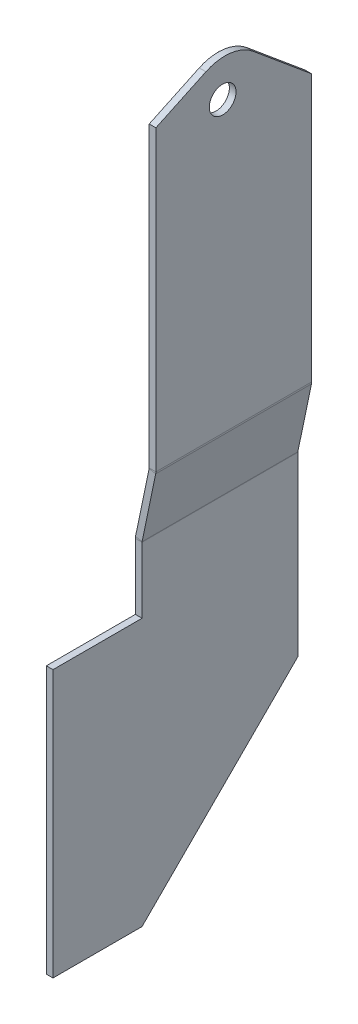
ISO-10303-21;
HEADER;
FILE_DESCRIPTION(('STEP AP214'),'2;1');
FILE_NAME('part.step','',(''),(''),'','','');
FILE_SCHEMA(('AUTOMOTIVE_DESIGN { 1 0 10303 214 1 1 1 1 }'));
ENDSEC;
DATA;
#1=APPLICATION_CONTEXT('core data for automotive mechanical design processes');
#2=APPLICATION_PROTOCOL_DEFINITION('international standard','automotive_design',2000,#1);
#3=PRODUCT_CONTEXT('',#1,'mechanical');
#4=PRODUCT('Part','Part','',(#3));
#5=PRODUCT_RELATED_PRODUCT_CATEGORY('part','',(#4));
#6=PRODUCT_DEFINITION_FORMATION('','',#4);
#7=PRODUCT_DEFINITION_CONTEXT('part definition',#1,'design');
#8=PRODUCT_DEFINITION('design','',#6,#7);
#9=PRODUCT_DEFINITION_SHAPE('','',#8);
#10=(LENGTH_UNIT() NAMED_UNIT(*) SI_UNIT(.MILLI.,.METRE.));
#11=(NAMED_UNIT(*) PLANE_ANGLE_UNIT() SI_UNIT($,.RADIAN.));
#12=(NAMED_UNIT(*) SI_UNIT($,.STERADIAN.) SOLID_ANGLE_UNIT());
#13=UNCERTAINTY_MEASURE_WITH_UNIT(LENGTH_MEASURE(1.E-05),#10,'distance_accuracy_value','');
#14=(GEOMETRIC_REPRESENTATION_CONTEXT(3) GLOBAL_UNCERTAINTY_ASSIGNED_CONTEXT((#13)) GLOBAL_UNIT_ASSIGNED_CONTEXT((#10,
#11,#12)) REPRESENTATION_CONTEXT('',''));
#15=CARTESIAN_POINT('',(0.,0.,0.));
#16=DIRECTION('',(0.,0.,1.));
#17=DIRECTION('',(1.,0.,0.));
#18=AXIS2_PLACEMENT_3D('',#15,#16,#17);
#19=CARTESIAN_POINT('',(0.,0.,110.));
#20=DIRECTION('',(-1.,0.,0.));
#21=DIRECTION('',(0.,0.,1.));
#22=AXIS2_PLACEMENT_3D('',#19,#20,#21);
#23=PLANE('',#22);
#24=DIRECTION('',(0.,1.,0.));
#25=VECTOR('',#24,1.);
#26=CARTESIAN_POINT('',(0.,0.,0.));
#27=LINE('',#26,#25);
#28=CARTESIAN_POINT('',(0.,70.,0.));
#29=VERTEX_POINT('',#28);
#30=CARTESIAN_POINT('',(0.,149.577452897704,0.));
#31=VERTEX_POINT('',#30);
#32=EDGE_CURVE('E178',#29,#31,#27,.T.);
#33=ORIENTED_EDGE('',*,*,#32,.F.);
#34=DIRECTION('',(0.,0.707106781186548,-0.707106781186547));
#35=VECTOR('',#34,1.);
#36=CARTESIAN_POINT('',(0.,-20.,90.));
#37=LINE('',#36,#35);
#38=CARTESIAN_POINT('',(0.,0.,70.));
#39=VERTEX_POINT('',#38);
#40=EDGE_CURVE('E155',#39,#29,#37,.T.);
#41=ORIENTED_EDGE('',*,*,#40,.F.);
#42=DIRECTION('',(0.,0.,-1.));
#43=VECTOR('',#42,1.);
#44=CARTESIAN_POINT('',(0.,0.,110.));
#45=LINE('',#44,#43);
#46=CARTESIAN_POINT('',(0.,0.,110.));
#47=VERTEX_POINT('',#46);
#48=EDGE_CURVE('E210',#47,#39,#45,.T.);
#49=ORIENTED_EDGE('',*,*,#48,.F.);
#50=DIRECTION('',(0.,1.,0.));
#51=VECTOR('',#50,1.);
#52=CARTESIAN_POINT('',(0.,0.,110.));
#53=LINE('',#52,#51);
#54=CARTESIAN_POINT('',(0.,120.,110.));
#55=VERTEX_POINT('',#54);
#56=EDGE_CURVE('E192',#47,#55,#53,.T.);
#57=ORIENTED_EDGE('',*,*,#56,.T.);
#58=DIRECTION('',(0.,0.,1.));
#59=VECTOR('',#58,1.);
#60=CARTESIAN_POINT('',(0.,120.,110.));
#61=LINE('',#60,#59);
#62=CARTESIAN_POINT('',(0.,120.,70.));
#63=VERTEX_POINT('',#62);
#64=EDGE_CURVE('E403',#63,#55,#61,.T.);
#65=ORIENTED_EDGE('',*,*,#64,.F.);
#66=DIRECTION('',(0.,1.,0.));
#67=VECTOR('',#66,1.);
#68=CARTESIAN_POINT('',(0.,0.,70.));
#69=LINE('',#68,#67);
#70=CARTESIAN_POINT('',(0.,149.577452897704,70.));
#71=VERTEX_POINT('',#70);
#72=EDGE_CURVE('E395',#71,#63,#69,.F.);
#73=ORIENTED_EDGE('',*,*,#72,.F.);
#74=DIRECTION('',(0.,0.,-1.));
#75=VECTOR('',#74,1.);
#76=CARTESIAN_POINT('',(0.,149.577452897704,110.));
#77=LINE('',#76,#75);
#78=EDGE_CURVE('E213',#71,#31,#77,.T.);
#79=ORIENTED_EDGE('',*,*,#78,.T.);
#80=EDGE_LOOP('',(#33,#41,#49,#57,#65,#73,#79));
#81=FACE_BOUND('',#80,.T.);
#82=ADVANCED_FACE('F33',(#81),#23,.T.);
#83=CARTESIAN_POINT('',(3.,0.,110.));
#84=DIRECTION('',(-1.,0.,0.));
#85=DIRECTION('',(0.,0.,1.));
#86=AXIS2_PLACEMENT_3D('',#83,#84,#85);
#87=PLANE('',#86);
#88=DIRECTION('',(0.,0.707106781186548,-0.707106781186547));
#89=VECTOR('',#88,1.);
#90=CARTESIAN_POINT('',(3.,-20.,90.));
#91=LINE('',#90,#89);
#92=CARTESIAN_POINT('',(3.,0.,70.));
#93=VERTEX_POINT('',#92);
#94=CARTESIAN_POINT('',(3.,70.,0.));
#95=VERTEX_POINT('',#94);
#96=EDGE_CURVE('E152',#93,#95,#91,.T.);
#97=ORIENTED_EDGE('',*,*,#96,.T.);
#98=DIRECTION('',(0.,1.,0.));
#99=VECTOR('',#98,1.);
#100=CARTESIAN_POINT('',(3.,0.,0.));
#101=LINE('',#100,#99);
#102=CARTESIAN_POINT('',(2.99999999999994,149.577452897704,0.));
#103=VERTEX_POINT('',#102);
#104=EDGE_CURVE('E166',#95,#103,#101,.T.);
#105=ORIENTED_EDGE('',*,*,#104,.T.);
#106=DIRECTION('',(0.,0.,-1.));
#107=VECTOR('',#106,1.);
#108=CARTESIAN_POINT('',(2.99999999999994,149.577452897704,110.));
#109=LINE('',#108,#107);
#110=CARTESIAN_POINT('',(2.99999999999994,149.577452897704,70.));
#111=VERTEX_POINT('',#110);
#112=EDGE_CURVE('E207',#111,#103,#109,.T.);
#113=ORIENTED_EDGE('',*,*,#112,.F.);
#114=DIRECTION('',(0.,-1.,0.));
#115=VECTOR('',#114,1.);
#116=CARTESIAN_POINT('',(3.,0.,70.));
#117=LINE('',#116,#115);
#118=CARTESIAN_POINT('',(3.,120.,70.));
#119=VERTEX_POINT('',#118);
#120=EDGE_CURVE('E388',#111,#119,#117,.T.);
#121=ORIENTED_EDGE('',*,*,#120,.T.);
#122=DIRECTION('',(0.,0.,1.));
#123=VECTOR('',#122,1.);
#124=CARTESIAN_POINT('',(3.,120.,110.));
#125=LINE('',#124,#123);
#126=CARTESIAN_POINT('',(3.,120.,110.));
#127=VERTEX_POINT('',#126);
#128=EDGE_CURVE('E389',#119,#127,#125,.T.);
#129=ORIENTED_EDGE('',*,*,#128,.T.);
#130=DIRECTION('',(0.,1.,0.));
#131=VECTOR('',#130,1.);
#132=CARTESIAN_POINT('',(3.,0.,110.));
#133=LINE('',#132,#131);
#134=CARTESIAN_POINT('',(3.,0.,110.));
#135=VERTEX_POINT('',#134);
#136=EDGE_CURVE('E198',#135,#127,#133,.T.);
#137=ORIENTED_EDGE('',*,*,#136,.F.);
#138=DIRECTION('',(0.,0.,-1.));
#139=VECTOR('',#138,1.);
#140=CARTESIAN_POINT('',(3.,0.,110.));
#141=LINE('',#140,#139);
#142=EDGE_CURVE('E169',#135,#93,#141,.T.);
#143=ORIENTED_EDGE('',*,*,#142,.T.);
#144=EDGE_LOOP('',(#97,#105,#113,#121,#129,#137,#143));
#145=FACE_BOUND('',#144,.T.);
#146=ADVANCED_FACE('F164',(#145),#87,.F.);
#147=CARTESIAN_POINT('',(3.02312153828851,149.801802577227,0.));
#148=DIRECTION('',(0.,0.,-1.));
#149=DIRECTION('',(-1.,0.,0.));
#150=AXIS2_PLACEMENT_3D('',#147,#148,#149);
#151=PLANE('',#150);
#152=ORIENTED_EDGE('',*,*,#104,.F.);
#153=DIRECTION('',(1.,0.,0.));
#154=VECTOR('',#153,1.);
#155=CARTESIAN_POINT('',(3.,70.,0.));
#156=LINE('',#155,#154);
#157=EDGE_CURVE('E149',#95,#29,#156,.F.);
#158=ORIENTED_EDGE('',*,*,#157,.T.);
#159=ORIENTED_EDGE('',*,*,#32,.T.);
#160=DIRECTION('',(1.,0.,0.));
#161=VECTOR('',#160,1.);
#162=CARTESIAN_POINT('',(0.,149.577452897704,0.));
#163=LINE('',#162,#161);
#164=EDGE_CURVE('E175',#31,#103,#163,.T.);
#165=ORIENTED_EDGE('',*,*,#164,.T.);
#166=EDGE_LOOP('',(#152,#158,#159,#165));
#167=FACE_BOUND('',#166,.T.);
#168=ADVANCED_FACE('F173',(#167),#151,.T.);
#169=CARTESIAN_POINT('',(3.,0.,110.));
#170=DIRECTION('',(0.,-1.,0.));
#171=DIRECTION('',(0.,0.,-1.));
#172=AXIS2_PLACEMENT_3D('',#169,#170,#171);
#173=PLANE('',#172);
#174=ORIENTED_EDGE('',*,*,#48,.T.);
#175=DIRECTION('',(1.,0.,0.));
#176=VECTOR('',#175,1.);
#177=CARTESIAN_POINT('',(3.,0.,70.));
#178=LINE('',#177,#176);
#179=EDGE_CURVE('E160',#93,#39,#178,.F.);
#180=ORIENTED_EDGE('',*,*,#179,.F.);
#181=ORIENTED_EDGE('',*,*,#142,.F.);
#182=DIRECTION('',(-1.,0.,0.));
#183=VECTOR('',#182,1.);
#184=CARTESIAN_POINT('',(3.,0.,110.));
#185=LINE('',#184,#183);
#186=EDGE_CURVE('E195',#135,#47,#185,.T.);
#187=ORIENTED_EDGE('',*,*,#186,.T.);
#188=EDGE_LOOP('',(#174,#180,#181,#187));
#189=FACE_BOUND('',#188,.T.);
#190=ADVANCED_FACE('F334',(#189),#173,.T.);
#191=CARTESIAN_POINT('',(9.25000000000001,180.,110.));
#192=DIRECTION('',(-1.,0.,0.));
#193=DIRECTION('',(0.,0.,1.));
#194=AXIS2_PLACEMENT_3D('',#191,#192,#193);
#195=PLANE('',#194);
#196=CARTESIAN_POINT('',(9.25000000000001,310.,40.));
#197=DIRECTION('',(1.,0.,0.));
#198=DIRECTION('',(0.,0.,-1.));
#199=AXIS2_PLACEMENT_3D('',#196,#197,#198);
#200=CIRCLE('',#199,6.);
#201=CARTESIAN_POINT('',(9.25,310.,34.));
#202=VERTEX_POINT('',#201);
#203=EDGE_CURVE('E235',#202,#202,#200,.T.);
#204=ORIENTED_EDGE('',*,*,#203,.F.);
#205=EDGE_LOOP('',(#204));
#206=FACE_BOUND('',#205,.T.);
#207=DIRECTION('',(0.,0.640184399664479,0.768221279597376));
#208=VECTOR('',#207,1.);
#209=CARTESIAN_POINT('',(9.25000000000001,300.,0.));
#210=LINE('',#209,#208);
#211=CARTESIAN_POINT('',(9.25000000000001,300.,0.));
#212=VERTEX_POINT('',#211);
#213=CARTESIAN_POINT('',(9.25000000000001,321.842099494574,26.210519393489));
#214=VERTEX_POINT('',#213);
#215=EDGE_CURVE('E245',#212,#214,#210,.T.);
#216=ORIENTED_EDGE('',*,*,#215,.T.);
#217=CARTESIAN_POINT('',(9.25000000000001,306.477673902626,39.0142073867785));
#218=DIRECTION('',(-1.,0.,0.));
#219=DIRECTION('',(0.,0.,1.));
#220=AXIS2_PLACEMENT_3D('',#217,#218,#219);
#221=CIRCLE('',#220,20.);
#222=CARTESIAN_POINT('',(9.25000000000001,324.574047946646,47.5301481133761));
#223=VERTEX_POINT('',#222);
#224=EDGE_CURVE('E55',#214,#223,#221,.F.);
#225=ORIENTED_EDGE('',*,*,#224,.T.);
#226=DIRECTION('',(0.,0.425797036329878,-0.904818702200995));
#227=VECTOR('',#226,1.);
#228=CARTESIAN_POINT('',(9.25000000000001,314.,70.));
#229=LINE('',#228,#227);
#230=CARTESIAN_POINT('',(9.25000000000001,314.,70.));
#231=VERTEX_POINT('',#230);
#232=EDGE_CURVE('E240',#223,#231,#229,.F.);
#233=ORIENTED_EDGE('',*,*,#232,.T.);
#234=DIRECTION('',(0.,1.,0.));
#235=VECTOR('',#234,1.);
#236=CARTESIAN_POINT('',(9.25000000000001,120.,70.));
#237=LINE('',#236,#235);
#238=CARTESIAN_POINT('',(9.25000000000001,180.113366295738,70.));
#239=VERTEX_POINT('',#238);
#240=EDGE_CURVE('E428',#239,#231,#237,.T.);
#241=ORIENTED_EDGE('',*,*,#240,.F.);
#242=DIRECTION('',(0.,0.,-1.));
#243=VECTOR('',#242,1.);
#244=CARTESIAN_POINT('',(9.25000000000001,180.113366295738,110.));
#245=LINE('',#244,#243);
#246=CARTESIAN_POINT('',(9.25000000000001,180.113366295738,0.));
#247=VERTEX_POINT('',#246);
#248=EDGE_CURVE('E201',#239,#247,#245,.T.);
#249=ORIENTED_EDGE('',*,*,#248,.T.);
#250=DIRECTION('',(0.,1.,0.));
#251=VECTOR('',#250,1.);
#252=CARTESIAN_POINT('',(9.25000000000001,180.,0.));
#253=LINE('',#252,#251);
#254=EDGE_CURVE('E262',#247,#212,#253,.T.);
#255=ORIENTED_EDGE('',*,*,#254,.T.);
#256=EDGE_LOOP('',(#216,#225,#233,#241,#249,#255));
#257=FACE_BOUND('',#256,.T.);
#258=ADVANCED_FACE('F260',(#206,#257),#195,.F.);
#259=CARTESIAN_POINT('',(6.25000000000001,180.,110.));
#260=DIRECTION('',(-1.,0.,0.));
#261=DIRECTION('',(0.,0.,1.));
#262=AXIS2_PLACEMENT_3D('',#259,#260,#261);
#263=PLANE('',#262);
#264=CARTESIAN_POINT('',(6.25000000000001,310.,40.));
#265=DIRECTION('',(-1.,0.,0.));
#266=DIRECTION('',(0.,0.,1.));
#267=AXIS2_PLACEMENT_3D('',#264,#265,#266);
#268=CIRCLE('',#267,6.);
#269=CARTESIAN_POINT('',(6.25000000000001,310.,34.));
#270=VERTEX_POINT('',#269);
#271=EDGE_CURVE('E170',#270,#270,#268,.T.);
#272=ORIENTED_EDGE('',*,*,#271,.F.);
#273=EDGE_LOOP('',(#272));
#274=FACE_BOUND('',#273,.T.);
#275=DIRECTION('',(0.,-0.425797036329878,0.904818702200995));
#276=VECTOR('',#275,1.);
#277=CARTESIAN_POINT('',(6.25000000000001,274.294617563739,154.373937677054));
#278=LINE('',#277,#276);
#279=CARTESIAN_POINT('',(6.25000000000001,314.,70.));
#280=VERTEX_POINT('',#279);
#281=CARTESIAN_POINT('',(6.25000000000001,324.574047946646,47.5301481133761));
#282=VERTEX_POINT('',#281);
#283=EDGE_CURVE('E238',#280,#282,#278,.F.);
#284=ORIENTED_EDGE('',*,*,#283,.T.);
#285=CARTESIAN_POINT('',(6.25000000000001,306.477673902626,39.0142073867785));
#286=DIRECTION('',(-1.,0.,0.));
#287=DIRECTION('',(0.,0.,1.));
#288=AXIS2_PLACEMENT_3D('',#285,#286,#287);
#289=CIRCLE('',#288,20.);
#290=CARTESIAN_POINT('',(6.25000000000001,321.842099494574,26.210519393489));
#291=VERTEX_POINT('',#290);
#292=EDGE_CURVE('E11',#282,#291,#289,.T.);
#293=ORIENTED_EDGE('',*,*,#292,.T.);
#294=DIRECTION('',(0.,-0.640184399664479,-0.768221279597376));
#295=VECTOR('',#294,1.);
#296=CARTESIAN_POINT('',(6.25000000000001,304.918032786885,5.90163934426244));
#297=LINE('',#296,#295);
#298=CARTESIAN_POINT('',(6.25000000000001,300.,0.));
#299=VERTEX_POINT('',#298);
#300=EDGE_CURVE('E247',#291,#299,#297,.T.);
#301=ORIENTED_EDGE('',*,*,#300,.T.);
#302=DIRECTION('',(0.,1.,0.));
#303=VECTOR('',#302,1.);
#304=CARTESIAN_POINT('',(6.25000000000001,180.,0.));
#305=LINE('',#304,#303);
#306=CARTESIAN_POINT('',(6.25000000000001,180.113366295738,0.));
#307=VERTEX_POINT('',#306);
#308=EDGE_CURVE('E267',#307,#299,#305,.T.);
#309=ORIENTED_EDGE('',*,*,#308,.F.);
#310=DIRECTION('',(0.,0.,-1.));
#311=VECTOR('',#310,1.);
#312=CARTESIAN_POINT('',(6.25000000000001,180.113366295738,110.));
#313=LINE('',#312,#311);
#314=CARTESIAN_POINT('',(6.25,180.113366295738,70.));
#315=VERTEX_POINT('',#314);
#316=EDGE_CURVE('E220',#315,#307,#313,.T.);
#317=ORIENTED_EDGE('',*,*,#316,.F.);
#318=DIRECTION('',(0.,1.,0.));
#319=VECTOR('',#318,1.);
#320=CARTESIAN_POINT('',(6.25,180.,70.));
#321=LINE('',#320,#319);
#322=EDGE_CURVE('E398',#315,#280,#321,.T.);
#323=ORIENTED_EDGE('',*,*,#322,.T.);
#324=EDGE_LOOP('',(#284,#293,#301,#309,#317,#323));
#325=FACE_BOUND('',#324,.T.);
#326=ADVANCED_FACE('F316',(#274,#325),#263,.T.);
#327=CARTESIAN_POINT('',(5.15,180.113366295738,110.));
#328=DIRECTION('',(0.,0.,-1.));
#329=DIRECTION('',(-1.,0.,0.));
#330=AXIS2_PLACEMENT_3D('',#327,#328,#329);
#331=CYLINDRICAL_SURFACE('',#330,1.1);
#332=DIRECTION('',(0.,0.,-1.));
#333=VECTOR('',#332,1.);
#334=CARTESIAN_POINT('',(6.22687846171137,179.889016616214,110.));
#335=LINE('',#334,#333);
#336=CARTESIAN_POINT('',(6.22687846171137,179.889016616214,70.));
#337=VERTEX_POINT('',#336);
#338=CARTESIAN_POINT('',(6.22687846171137,179.889016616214,0.));
#339=VERTEX_POINT('',#338);
#340=EDGE_CURVE('E218',#337,#339,#335,.T.);
#341=ORIENTED_EDGE('',*,*,#340,.F.);
#342=CARTESIAN_POINT('',(5.15,180.113366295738,70.));
#343=DIRECTION('',(0.,0.,-1.));
#344=DIRECTION('',(-1.,0.,0.));
#345=AXIS2_PLACEMENT_3D('',#342,#343,#344);
#346=CIRCLE('',#345,1.1);
#347=EDGE_CURVE('E311',#315,#337,#346,.T.);
#348=ORIENTED_EDGE('',*,*,#347,.F.);
#349=ORIENTED_EDGE('',*,*,#316,.T.);
#350=CARTESIAN_POINT('',(5.15,180.113366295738,0.));
#351=DIRECTION('',(0.,0.,1.));
#352=DIRECTION('',(1.,0.,0.));
#353=AXIS2_PLACEMENT_3D('',#350,#351,#352);
#354=CIRCLE('',#353,1.1);
#355=EDGE_CURVE('E271',#339,#307,#354,.T.);
#356=ORIENTED_EDGE('',*,*,#355,.F.);
#357=EDGE_LOOP('',(#341,#348,#349,#356));
#358=FACE_BOUND('',#357,.T.);
#359=ADVANCED_FACE('F309',(#358),#331,.F.);
#360=CARTESIAN_POINT('',(0.,150.,110.));
#361=DIRECTION('',(-0.978980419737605,0.203954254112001,0.));
#362=DIRECTION('',(-0.203954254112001,-0.978980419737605,0.));
#363=AXIS2_PLACEMENT_3D('',#360,#361,#362);
#364=PLANE('',#363);
#365=DIRECTION('',(0.,0.,-1.));
#366=VECTOR('',#365,1.);
#367=CARTESIAN_POINT('',(0.0861802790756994,150.413665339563,110.));
#368=LINE('',#367,#366);
#369=CARTESIAN_POINT('',(0.0861802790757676,150.413665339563,70.));
#370=VERTEX_POINT('',#369);
#371=CARTESIAN_POINT('',(0.0861802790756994,150.413665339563,0.));
#372=VERTEX_POINT('',#371);
#373=EDGE_CURVE('E216',#370,#372,#368,.T.);
#374=ORIENTED_EDGE('',*,*,#373,.F.);
#375=DIRECTION('',(-0.203954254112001,-0.978980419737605,0.));
#376=VECTOR('',#375,1.);
#377=CARTESIAN_POINT('',(0.,150.,70.));
#378=LINE('',#377,#376);
#379=EDGE_CURVE('E303',#337,#370,#378,.T.);
#380=ORIENTED_EDGE('',*,*,#379,.F.);
#381=ORIENTED_EDGE('',*,*,#340,.T.);
#382=DIRECTION('',(0.203954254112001,0.978980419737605,0.));
#383=VECTOR('',#382,1.);
#384=CARTESIAN_POINT('',(0.,150.,0.));
#385=LINE('',#384,#383);
#386=EDGE_CURVE('E281',#372,#339,#385,.T.);
#387=ORIENTED_EDGE('',*,*,#386,.F.);
#388=EDGE_LOOP('',(#374,#380,#381,#387));
#389=FACE_BOUND('',#388,.T.);
#390=ADVANCED_FACE('F300',(#389),#364,.T.);
#391=CARTESIAN_POINT('',(4.09999999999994,149.577452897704,110.));
#392=DIRECTION('',(0.,0.,-1.));
#393=DIRECTION('',(-1.,0.,0.));
#394=AXIS2_PLACEMENT_3D('',#391,#392,#393);
#395=CYLINDRICAL_SURFACE('',#394,4.1);
#396=ORIENTED_EDGE('',*,*,#78,.F.);
#397=CARTESIAN_POINT('',(4.09999999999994,149.577452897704,70.));
#398=DIRECTION('',(0.,0.,-1.));
#399=DIRECTION('',(-1.,0.,0.));
#400=AXIS2_PLACEMENT_3D('',#397,#398,#399);
#401=CIRCLE('',#400,4.1);
#402=EDGE_CURVE('E293',#370,#71,#401,.F.);
#403=ORIENTED_EDGE('',*,*,#402,.F.);
#404=ORIENTED_EDGE('',*,*,#373,.T.);
#405=CARTESIAN_POINT('',(4.09999999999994,149.577452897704,0.));
#406=DIRECTION('',(0.,0.,-1.));
#407=DIRECTION('',(-1.,0.,0.));
#408=AXIS2_PLACEMENT_3D('',#405,#406,#407);
#409=CIRCLE('',#408,4.1);
#410=EDGE_CURVE('E183',#31,#372,#409,.T.);
#411=ORIENTED_EDGE('',*,*,#410,.F.);
#412=EDGE_LOOP('',(#396,#403,#404,#411));
#413=FACE_BOUND('',#412,.T.);
#414=ADVANCED_FACE('F290',(#413),#395,.T.);
#415=CARTESIAN_POINT('',(4.09999999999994,149.577452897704,110.));
#416=DIRECTION('',(0.,0.,-1.));
#417=DIRECTION('',(-1.,0.,0.));
#418=AXIS2_PLACEMENT_3D('',#415,#416,#417);
#419=CYLINDRICAL_SURFACE('',#418,1.1);
#420=CARTESIAN_POINT('',(4.09999999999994,149.577452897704,70.));
#421=DIRECTION('',(0.,0.,-1.));
#422=DIRECTION('',(-1.,0.,0.));
#423=AXIS2_PLACEMENT_3D('',#420,#421,#422);
#424=CIRCLE('',#423,1.1);
#425=CARTESIAN_POINT('',(3.02312153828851,149.801802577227,70.));
#426=VERTEX_POINT('',#425);
#427=EDGE_CURVE('E159',#426,#111,#424,.F.);
#428=ORIENTED_EDGE('',*,*,#427,.T.);
#429=ORIENTED_EDGE('',*,*,#112,.T.);
#430=CARTESIAN_POINT('',(4.09999999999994,149.577452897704,0.));
#431=DIRECTION('',(0.,0.,1.));
#432=DIRECTION('',(1.,0.,0.));
#433=AXIS2_PLACEMENT_3D('',#430,#431,#432);
#434=CIRCLE('',#433,1.1);
#435=CARTESIAN_POINT('',(3.02312153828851,149.801802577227,0.));
#436=VERTEX_POINT('',#435);
#437=EDGE_CURVE('E177',#103,#436,#434,.F.);
#438=ORIENTED_EDGE('',*,*,#437,.T.);
#439=DIRECTION('',(0.,0.,-1.));
#440=VECTOR('',#439,1.);
#441=CARTESIAN_POINT('',(3.02312153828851,149.801802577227,110.));
#442=LINE('',#441,#440);
#443=EDGE_CURVE('E205',#426,#436,#442,.T.);
#444=ORIENTED_EDGE('',*,*,#443,.F.);
#445=EDGE_LOOP('',(#428,#429,#438,#444));
#446=FACE_BOUND('',#445,.T.);
#447=ADVANCED_FACE('F337',(#446),#419,.F.);
#448=CARTESIAN_POINT('',(2.93694125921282,149.388137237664,110.));
#449=DIRECTION('',(-0.978980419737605,0.203954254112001,0.));
#450=DIRECTION('',(-0.203954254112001,-0.978980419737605,0.));
#451=AXIS2_PLACEMENT_3D('',#448,#449,#450);
#452=PLANE('',#451);
#453=DIRECTION('',(-0.203954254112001,-0.978980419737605,0.));
#454=VECTOR('',#453,1.);
#455=CARTESIAN_POINT('',(2.93694125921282,149.388137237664,70.));
#456=LINE('',#455,#454);
#457=CARTESIAN_POINT('',(9.16381972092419,179.277153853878,70.));
#458=VERTEX_POINT('',#457);
#459=EDGE_CURVE('E422',#458,#426,#456,.T.);
#460=ORIENTED_EDGE('',*,*,#459,.T.);
#461=ORIENTED_EDGE('',*,*,#443,.T.);
#462=DIRECTION('',(0.203954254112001,0.978980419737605,0.));
#463=VECTOR('',#462,1.);
#464=CARTESIAN_POINT('',(2.93694125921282,149.388137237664,0.));
#465=LINE('',#464,#463);
#466=CARTESIAN_POINT('',(9.16381972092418,179.277153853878,0.));
#467=VERTEX_POINT('',#466);
#468=EDGE_CURVE('E181',#436,#467,#465,.T.);
#469=ORIENTED_EDGE('',*,*,#468,.T.);
#470=DIRECTION('',(0.,0.,-1.));
#471=VECTOR('',#470,1.);
#472=CARTESIAN_POINT('',(9.16381972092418,179.277153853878,110.));
#473=LINE('',#472,#471);
#474=EDGE_CURVE('E203',#458,#467,#473,.T.);
#475=ORIENTED_EDGE('',*,*,#474,.F.);
#476=EDGE_LOOP('',(#460,#461,#469,#475));
#477=FACE_BOUND('',#476,.T.);
#478=ADVANCED_FACE('F365',(#477),#452,.F.);
#479=CARTESIAN_POINT('',(5.15,180.113366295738,110.));
#480=DIRECTION('',(0.,0.,-1.));
#481=DIRECTION('',(-1.,0.,0.));
#482=AXIS2_PLACEMENT_3D('',#479,#480,#481);
#483=CYLINDRICAL_SURFACE('',#482,4.1);
#484=CARTESIAN_POINT('',(5.15,180.113366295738,70.));
#485=DIRECTION('',(0.,0.,-1.));
#486=DIRECTION('',(-1.,0.,0.));
#487=AXIS2_PLACEMENT_3D('',#484,#485,#486);
#488=CIRCLE('',#487,4.1);
#489=EDGE_CURVE('E418',#239,#458,#488,.T.);
#490=ORIENTED_EDGE('',*,*,#489,.T.);
#491=ORIENTED_EDGE('',*,*,#474,.T.);
#492=CARTESIAN_POINT('',(5.15,180.113366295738,0.));
#493=DIRECTION('',(0.,0.,1.));
#494=DIRECTION('',(1.,0.,0.));
#495=AXIS2_PLACEMENT_3D('',#492,#493,#494);
#496=CIRCLE('',#495,4.1);
#497=EDGE_CURVE('E189',#467,#247,#496,.T.);
#498=ORIENTED_EDGE('',*,*,#497,.T.);
#499=ORIENTED_EDGE('',*,*,#248,.F.);
#500=EDGE_LOOP('',(#490,#491,#498,#499));
#501=FACE_BOUND('',#500,.T.);
#502=ADVANCED_FACE('F359',(#501),#483,.T.);
#503=CARTESIAN_POINT('',(5.15,180.113366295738,110.));
#504=DIRECTION('',(0.,0.,1.));
#505=DIRECTION('',(1.,0.,0.));
#506=AXIS2_PLACEMENT_3D('',#503,#504,#505);
#507=PLANE('',#506);
#508=ORIENTED_EDGE('',*,*,#136,.T.);
#509=DIRECTION('',(1.,0.,0.));
#510=VECTOR('',#509,1.);
#511=CARTESIAN_POINT('',(3.,120.,110.));
#512=LINE('',#511,#510);
#513=EDGE_CURVE('E268',#127,#55,#512,.F.);
#514=ORIENTED_EDGE('',*,*,#513,.T.);
#515=ORIENTED_EDGE('',*,*,#56,.F.);
#516=ORIENTED_EDGE('',*,*,#186,.F.);
#517=EDGE_LOOP('',(#508,#514,#515,#516));
#518=FACE_BOUND('',#517,.T.);
#519=ADVANCED_FACE('F355',(#518),#507,.T.);
#520=CARTESIAN_POINT('',(6.22687846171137,179.889016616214,0.));
#521=DIRECTION('',(0.,0.,-1.));
#522=DIRECTION('',(-1.,0.,0.));
#523=AXIS2_PLACEMENT_3D('',#520,#521,#522);
#524=PLANE('',#523);
#525=DIRECTION('',(0.978980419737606,-0.203954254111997,0.));
#526=VECTOR('',#525,1.);
#527=CARTESIAN_POINT('',(6.22687846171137,179.889016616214,0.));
#528=LINE('',#527,#526);
#529=EDGE_CURVE('E229',#339,#467,#528,.T.);
#530=ORIENTED_EDGE('',*,*,#529,.F.);
#531=ORIENTED_EDGE('',*,*,#355,.T.);
#532=DIRECTION('',(-1.,0.,0.));
#533=VECTOR('',#532,1.);
#534=CARTESIAN_POINT('',(9.25000000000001,180.113366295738,0.));
#535=LINE('',#534,#533);
#536=EDGE_CURVE('E226',#247,#307,#535,.T.);
#537=ORIENTED_EDGE('',*,*,#536,.F.);
#538=ORIENTED_EDGE('',*,*,#497,.F.);
#539=EDGE_LOOP('',(#530,#531,#537,#538));
#540=FACE_BOUND('',#539,.T.);
#541=ADVANCED_FACE('F35',(#540),#524,.T.);
#542=CARTESIAN_POINT('',(9.25000000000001,180.113366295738,0.));
#543=DIRECTION('',(0.,0.,-1.));
#544=DIRECTION('',(-1.,0.,0.));
#545=AXIS2_PLACEMENT_3D('',#542,#543,#544);
#546=PLANE('',#545);
#547=ORIENTED_EDGE('',*,*,#386,.T.);
#548=ORIENTED_EDGE('',*,*,#529,.T.);
#549=ORIENTED_EDGE('',*,*,#468,.F.);
#550=DIRECTION('',(-0.978980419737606,0.203954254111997,0.));
#551=VECTOR('',#550,1.);
#552=CARTESIAN_POINT('',(3.02312153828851,149.801802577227,0.));
#553=LINE('',#552,#551);
#554=EDGE_CURVE('E222',#436,#372,#553,.T.);
#555=ORIENTED_EDGE('',*,*,#554,.T.);
#556=EDGE_LOOP('',(#547,#548,#549,#555));
#557=FACE_BOUND('',#556,.T.);
#558=ADVANCED_FACE('F299',(#557),#546,.T.);
#559=CARTESIAN_POINT('',(0.,149.577452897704,0.));
#560=DIRECTION('',(0.,0.,-1.));
#561=DIRECTION('',(-1.,0.,0.));
#562=AXIS2_PLACEMENT_3D('',#559,#560,#561);
#563=PLANE('',#562);
#564=ORIENTED_EDGE('',*,*,#164,.F.);
#565=ORIENTED_EDGE('',*,*,#410,.T.);
#566=ORIENTED_EDGE('',*,*,#554,.F.);
#567=ORIENTED_EDGE('',*,*,#437,.F.);
#568=EDGE_LOOP('',(#564,#565,#566,#567));
#569=FACE_BOUND('',#568,.T.);
#570=ADVANCED_FACE('F287',(#569),#563,.T.);
#571=CARTESIAN_POINT('',(5.15,180.113366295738,0.));
#572=DIRECTION('',(0.,0.,1.));
#573=DIRECTION('',(1.,0.,0.));
#574=AXIS2_PLACEMENT_3D('',#571,#572,#573);
#575=PLANE('',#574);
#576=ORIENTED_EDGE('',*,*,#308,.T.);
#577=DIRECTION('',(1.,0.,0.));
#578=VECTOR('',#577,1.);
#579=CARTESIAN_POINT('',(9.25000000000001,300.,0.));
#580=LINE('',#579,#578);
#581=EDGE_CURVE('E242',#299,#212,#580,.T.);
#582=ORIENTED_EDGE('',*,*,#581,.T.);
#583=ORIENTED_EDGE('',*,*,#254,.F.);
#584=ORIENTED_EDGE('',*,*,#536,.T.);
#585=EDGE_LOOP('',(#576,#582,#583,#584));
#586=FACE_BOUND('',#585,.T.);
#587=ADVANCED_FACE('F315',(#586),#575,.F.);
#588=CARTESIAN_POINT('',(3.,120.,110.));
#589=DIRECTION('',(0.,-1.,0.));
#590=DIRECTION('',(0.,0.,1.));
#591=AXIS2_PLACEMENT_3D('',#588,#589,#590);
#592=PLANE('',#591);
#593=ORIENTED_EDGE('',*,*,#513,.F.);
#594=ORIENTED_EDGE('',*,*,#128,.F.);
#595=DIRECTION('',(1.,0.,0.));
#596=VECTOR('',#595,1.);
#597=CARTESIAN_POINT('',(3.,120.,70.));
#598=LINE('',#597,#596);
#599=EDGE_CURVE('E274',#119,#63,#598,.F.);
#600=ORIENTED_EDGE('',*,*,#599,.T.);
#601=ORIENTED_EDGE('',*,*,#64,.T.);
#602=EDGE_LOOP('',(#593,#594,#600,#601));
#603=FACE_BOUND('',#602,.T.);
#604=ADVANCED_FACE('F411',(#603),#592,.F.);
#605=CARTESIAN_POINT('',(3.,0.,70.));
#606=DIRECTION('',(0.,0.,-1.));
#607=DIRECTION('',(0.,-1.,0.));
#608=AXIS2_PLACEMENT_3D('',#605,#606,#607);
#609=PLANE('',#608);
#610=ORIENTED_EDGE('',*,*,#599,.F.);
#611=ORIENTED_EDGE('',*,*,#120,.F.);
#612=DIRECTION('',(1.,0.,0.));
#613=VECTOR('',#612,1.);
#614=CARTESIAN_POINT('',(2.99999999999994,149.577452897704,70.));
#615=LINE('',#614,#613);
#616=EDGE_CURVE('E277',#111,#71,#615,.F.);
#617=ORIENTED_EDGE('',*,*,#616,.T.);
#618=ORIENTED_EDGE('',*,*,#72,.T.);
#619=EDGE_LOOP('',(#610,#611,#617,#618));
#620=FACE_BOUND('',#619,.T.);
#621=ADVANCED_FACE('F409',(#620),#609,.F.);
#622=CARTESIAN_POINT('',(9.25000000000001,120.,70.));
#623=DIRECTION('',(0.,0.,1.));
#624=DIRECTION('',(0.,1.,0.));
#625=AXIS2_PLACEMENT_3D('',#622,#623,#624);
#626=PLANE('',#625);
#627=ORIENTED_EDGE('',*,*,#240,.T.);
#628=DIRECTION('',(-1.,0.,0.));
#629=VECTOR('',#628,1.);
#630=CARTESIAN_POINT('',(9.25000000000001,314.,70.));
#631=LINE('',#630,#629);
#632=EDGE_CURVE('E232',#231,#280,#631,.T.);
#633=ORIENTED_EDGE('',*,*,#632,.T.);
#634=ORIENTED_EDGE('',*,*,#322,.F.);
#635=DIRECTION('',(1.,0.,0.));
#636=VECTOR('',#635,1.);
#637=CARTESIAN_POINT('',(9.25000000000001,180.113366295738,70.));
#638=LINE('',#637,#636);
#639=EDGE_CURVE('E393',#239,#315,#638,.F.);
#640=ORIENTED_EDGE('',*,*,#639,.F.);
#641=EDGE_LOOP('',(#627,#633,#634,#640));
#642=FACE_BOUND('',#641,.T.);
#643=ADVANCED_FACE('F433',(#642),#626,.T.);
#644=CARTESIAN_POINT('',(2.93694125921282,149.388137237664,70.));
#645=DIRECTION('',(0.,0.,-1.));
#646=DIRECTION('',(-0.203954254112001,-0.978980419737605,0.));
#647=AXIS2_PLACEMENT_3D('',#644,#645,#646);
#648=PLANE('',#647);
#649=DIRECTION('',(0.978980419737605,-0.203954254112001,0.));
#650=VECTOR('',#649,1.);
#651=CARTESIAN_POINT('',(3.02312153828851,149.801802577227,70.));
#652=LINE('',#651,#650);
#653=EDGE_CURVE('E426',#426,#370,#652,.F.);
#654=ORIENTED_EDGE('',*,*,#653,.F.);
#655=ORIENTED_EDGE('',*,*,#459,.F.);
#656=DIRECTION('',(0.978980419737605,-0.203954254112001,0.));
#657=VECTOR('',#656,1.);
#658=CARTESIAN_POINT('',(9.16381972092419,179.277153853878,70.));
#659=LINE('',#658,#657);
#660=EDGE_CURVE('E425',#458,#337,#659,.F.);
#661=ORIENTED_EDGE('',*,*,#660,.T.);
#662=ORIENTED_EDGE('',*,*,#379,.T.);
#663=EDGE_LOOP('',(#654,#655,#661,#662));
#664=FACE_BOUND('',#663,.T.);
#665=ADVANCED_FACE('F441',(#664),#648,.F.);
#666=CARTESIAN_POINT('',(5.15,180.113366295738,70.));
#667=DIRECTION('',(0.,0.,1.));
#668=DIRECTION('',(1.,0.,0.));
#669=AXIS2_PLACEMENT_3D('',#666,#667,#668);
#670=PLANE('',#669);
#671=ORIENTED_EDGE('',*,*,#660,.F.);
#672=ORIENTED_EDGE('',*,*,#489,.F.);
#673=ORIENTED_EDGE('',*,*,#639,.T.);
#674=ORIENTED_EDGE('',*,*,#347,.T.);
#675=EDGE_LOOP('',(#671,#672,#673,#674));
#676=FACE_BOUND('',#675,.T.);
#677=ADVANCED_FACE('F438',(#676),#670,.T.);
#678=CARTESIAN_POINT('',(4.09999999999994,149.577452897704,70.));
#679=DIRECTION('',(0.,0.,1.));
#680=DIRECTION('',(1.,0.,0.));
#681=AXIS2_PLACEMENT_3D('',#678,#679,#680);
#682=PLANE('',#681);
#683=ORIENTED_EDGE('',*,*,#616,.F.);
#684=ORIENTED_EDGE('',*,*,#427,.F.);
#685=ORIENTED_EDGE('',*,*,#653,.T.);
#686=ORIENTED_EDGE('',*,*,#402,.T.);
#687=EDGE_LOOP('',(#683,#684,#685,#686));
#688=FACE_BOUND('',#687,.T.);
#689=ADVANCED_FACE('F442',(#688),#682,.T.);
#690=CARTESIAN_POINT('',(3.,-20.,90.));
#691=DIRECTION('',(0.,0.707106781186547,0.707106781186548));
#692=DIRECTION('',(0.,0.707106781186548,-0.707106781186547));
#693=AXIS2_PLACEMENT_3D('',#690,#691,#692);
#694=PLANE('',#693);
#695=ORIENTED_EDGE('',*,*,#157,.F.);
#696=ORIENTED_EDGE('',*,*,#96,.F.);
#697=ORIENTED_EDGE('',*,*,#179,.T.);
#698=ORIENTED_EDGE('',*,*,#40,.T.);
#699=EDGE_LOOP('',(#695,#696,#697,#698));
#700=FACE_BOUND('',#699,.T.);
#701=ADVANCED_FACE('F151',(#700),#694,.F.);
#702=CARTESIAN_POINT('',(0.,310.,40.));
#703=DIRECTION('',(1.,0.,0.));
#704=DIRECTION('',(0.,0.,-1.));
#705=AXIS2_PLACEMENT_3D('',#702,#703,#704);
#706=CYLINDRICAL_SURFACE('',#705,6.);
#707=CARTESIAN_POINT('',(6.25000000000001,310.,34.));
#708=CARTESIAN_POINT('',(6.28125000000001,310.,34.));
#709=CARTESIAN_POINT('',(6.31250000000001,310.,34.));
#710=CARTESIAN_POINT('',(6.37500000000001,310.,34.));
#711=CARTESIAN_POINT('',(6.40625000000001,310.,34.));
#712=CARTESIAN_POINT('',(6.46875000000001,310.,34.));
#713=CARTESIAN_POINT('',(6.50000000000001,310.,34.));
#714=CARTESIAN_POINT('',(6.56250000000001,310.,34.));
#715=CARTESIAN_POINT('',(6.59375000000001,310.,34.));
#716=CARTESIAN_POINT('',(6.65625000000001,310.,34.));
#717=CARTESIAN_POINT('',(6.68750000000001,310.,34.));
#718=CARTESIAN_POINT('',(6.75000000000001,310.,34.));
#719=CARTESIAN_POINT('',(6.78125000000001,310.,34.));
#720=CARTESIAN_POINT('',(6.84375000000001,310.,34.));
#721=CARTESIAN_POINT('',(6.87500000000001,310.,34.));
#722=CARTESIAN_POINT('',(6.93750000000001,310.,34.));
#723=CARTESIAN_POINT('',(6.96875000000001,310.,34.));
#724=CARTESIAN_POINT('',(7.03125000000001,310.,34.));
#725=CARTESIAN_POINT('',(7.06250000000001,310.,34.));
#726=CARTESIAN_POINT('',(7.12500000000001,310.,34.));
#727=CARTESIAN_POINT('',(7.15625000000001,310.,34.));
#728=CARTESIAN_POINT('',(7.21875000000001,310.,34.));
#729=CARTESIAN_POINT('',(7.25000000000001,310.,34.));
#730=CARTESIAN_POINT('',(7.31250000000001,310.,34.));
#731=CARTESIAN_POINT('',(7.34375000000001,310.,34.));
#732=CARTESIAN_POINT('',(7.40625000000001,310.,34.));
#733=CARTESIAN_POINT('',(7.43750000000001,310.,34.));
#734=CARTESIAN_POINT('',(7.50000000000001,310.,34.));
#735=CARTESIAN_POINT('',(7.53125000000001,310.,34.));
#736=CARTESIAN_POINT('',(7.59375000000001,310.,34.));
#737=CARTESIAN_POINT('',(7.62500000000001,310.,34.));
#738=CARTESIAN_POINT('',(7.68750000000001,310.,34.));
#739=CARTESIAN_POINT('',(7.71875000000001,310.,34.));
#740=CARTESIAN_POINT('',(7.78125,310.,34.));
#741=CARTESIAN_POINT('',(7.8125,310.,34.));
#742=CARTESIAN_POINT('',(7.875,310.,34.));
#743=CARTESIAN_POINT('',(7.90625,310.,34.));
#744=CARTESIAN_POINT('',(7.96875,310.,34.));
#745=CARTESIAN_POINT('',(8.,310.,34.));
#746=CARTESIAN_POINT('',(8.0625,310.,34.));
#747=CARTESIAN_POINT('',(8.09375,310.,34.));
#748=CARTESIAN_POINT('',(8.15625,310.,34.));
#749=CARTESIAN_POINT('',(8.1875,310.,34.));
#750=CARTESIAN_POINT('',(8.25,310.,34.));
#751=CARTESIAN_POINT('',(8.28125,310.,34.));
#752=CARTESIAN_POINT('',(8.34375,310.,34.));
#753=CARTESIAN_POINT('',(8.375,310.,34.));
#754=CARTESIAN_POINT('',(8.4375,310.,34.));
#755=CARTESIAN_POINT('',(8.46875,310.,34.));
#756=CARTESIAN_POINT('',(8.53125,310.,34.));
#757=CARTESIAN_POINT('',(8.5625,310.,34.));
#758=CARTESIAN_POINT('',(8.625,310.,34.));
#759=CARTESIAN_POINT('',(8.65625,310.,34.));
#760=CARTESIAN_POINT('',(8.71875,310.,34.));
#761=CARTESIAN_POINT('',(8.75,310.,34.));
#762=CARTESIAN_POINT('',(8.8125,310.,34.));
#763=CARTESIAN_POINT('',(8.84375,310.,34.));
#764=CARTESIAN_POINT('',(8.90625,310.,34.));
#765=CARTESIAN_POINT('',(8.9375,310.,34.));
#766=CARTESIAN_POINT('',(9.,310.,34.));
#767=CARTESIAN_POINT('',(9.03125,310.,34.));
#768=CARTESIAN_POINT('',(9.09375,310.,34.));
#769=CARTESIAN_POINT('',(9.125,310.,34.));
#770=CARTESIAN_POINT('',(9.1875,310.,34.));
#771=CARTESIAN_POINT('',(9.21875,310.,34.));
#772=CARTESIAN_POINT('',(9.25,310.,34.));
#773=B_SPLINE_CURVE_WITH_KNOTS('',3,(#707,#708,#709,#710,#711,#712,#713,#714,#715,#716,#717,
#718,#719,#720,#721,#722,#723,#724,#725,#726,#727,#728,#729,#730,#731,#732,#733,#734,#735,#736,
#737,#738,#739,#740,#741,#742,#743,#744,#745,#746,#747,#748,#749,#750,#751,#752,#753,#754,#755,
#756,#757,#758,#759,#760,#761,#762,#763,#764,#765,#766,#767,#768,#769,#770,#771,#772),
.UNSPECIFIED.,.F.,.F.,(4,2,2,2,2,2,2,2,2,2,2,2,2,2,2,2,2,2,2,2,2,2,2,2,2,2,2,2,2,2,2,2,4),(0.,
0.0937500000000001,0.1875,0.281249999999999,0.374999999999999,0.46875,0.5625,0.65625,
0.749999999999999,0.843749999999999,0.937499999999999,1.03125,1.125,1.21875,1.3125,1.40625,1.5,
1.59375,1.6875,1.78125,1.875,1.96875,2.0625,2.15625,2.25,2.34375,2.4375,2.53125,2.625,2.71875,
2.8125,2.90625,3.),.UNSPECIFIED.);
#774=EDGE_CURVE('BSEAM449',#270,#202,#773,.T.);
#775=ORIENTED_EDGE('',*,*,#271,.T.);
#776=ORIENTED_EDGE('',*,*,#203,.T.);
#777=ORIENTED_EDGE('',*,*,#774,.T.);
#778=ORIENTED_EDGE('',*,*,#774,.F.);
#779=EDGE_LOOP('',(#775,#777,#776,#778));
#780=FACE_BOUND('',#779,.T.);
#781=ADVANCED_FACE('F449',(#780),#706,.F.);
#782=CARTESIAN_POINT('',(9.25000000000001,314.,70.));
#783=DIRECTION('',(0.,-0.904818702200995,-0.425797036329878));
#784=DIRECTION('',(0.,0.425797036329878,-0.904818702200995));
#785=AXIS2_PLACEMENT_3D('',#782,#783,#784);
#786=PLANE('',#785);
#787=ORIENTED_EDGE('',*,*,#232,.F.);
#788=DIRECTION('',(1.,0.,0.));
#789=VECTOR('',#788,1.);
#790=CARTESIAN_POINT('',(9.25000000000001,324.574047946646,47.5301481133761));
#791=LINE('',#790,#789);
#792=EDGE_CURVE('E41',#223,#282,#791,.F.);
#793=ORIENTED_EDGE('',*,*,#792,.T.);
#794=ORIENTED_EDGE('',*,*,#283,.F.);
#795=ORIENTED_EDGE('',*,*,#632,.F.);
#796=EDGE_LOOP('',(#787,#793,#794,#795));
#797=FACE_BOUND('',#796,.T.);
#798=ADVANCED_FACE('F323',(#797),#786,.F.);
#799=CARTESIAN_POINT('',(5.15,300.,0.));
#800=DIRECTION('',(0.,0.768221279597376,-0.640184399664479));
#801=DIRECTION('',(0.,0.640184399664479,0.768221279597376));
#802=AXIS2_PLACEMENT_3D('',#799,#800,#801);
#803=PLANE('',#802);
#804=ORIENTED_EDGE('',*,*,#300,.F.);
#805=DIRECTION('',(-1.,0.,0.));
#806=VECTOR('',#805,1.);
#807=CARTESIAN_POINT('',(5.15,321.842099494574,26.210519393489));
#808=LINE('',#807,#806);
#809=EDGE_CURVE('E249',#291,#214,#808,.F.);
#810=ORIENTED_EDGE('',*,*,#809,.T.);
#811=ORIENTED_EDGE('',*,*,#215,.F.);
#812=ORIENTED_EDGE('',*,*,#581,.F.);
#813=EDGE_LOOP('',(#804,#810,#811,#812));
#814=FACE_BOUND('',#813,.T.);
#815=ADVANCED_FACE('F255',(#814),#803,.T.);
#816=CARTESIAN_POINT('',(5.15,306.477673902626,39.0142073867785));
#817=DIRECTION('',(-1.,0.,0.));
#818=DIRECTION('',(0.,0.,1.));
#819=AXIS2_PLACEMENT_3D('',#816,#817,#818);
#820=CYLINDRICAL_SURFACE('',#819,20.);
#821=ORIENTED_EDGE('',*,*,#292,.F.);
#822=ORIENTED_EDGE('',*,*,#792,.F.);
#823=ORIENTED_EDGE('',*,*,#224,.F.);
#824=ORIENTED_EDGE('',*,*,#809,.F.);
#825=EDGE_LOOP('',(#821,#822,#823,#824));
#826=FACE_BOUND('',#825,.T.);
#827=ADVANCED_FACE('F317',(#826),#820,.T.);
#828=CLOSED_SHELL('',(#82,#146,#168,#190,#258,#326,#359,#390,#414,#447,#478,#502,#519,#541,#558,
#570,#587,#604,#621,#643,#665,#677,#689,#701,#781,#798,#815,#827));
#829=MANIFOLD_SOLID_BREP('B2',#828);
#830=ADVANCED_BREP_SHAPE_REPRESENTATION('',(#18,#829),#14);
#831=SHAPE_DEFINITION_REPRESENTATION(#9,#830);
ENDSEC;
END-ISO-10303-21;
